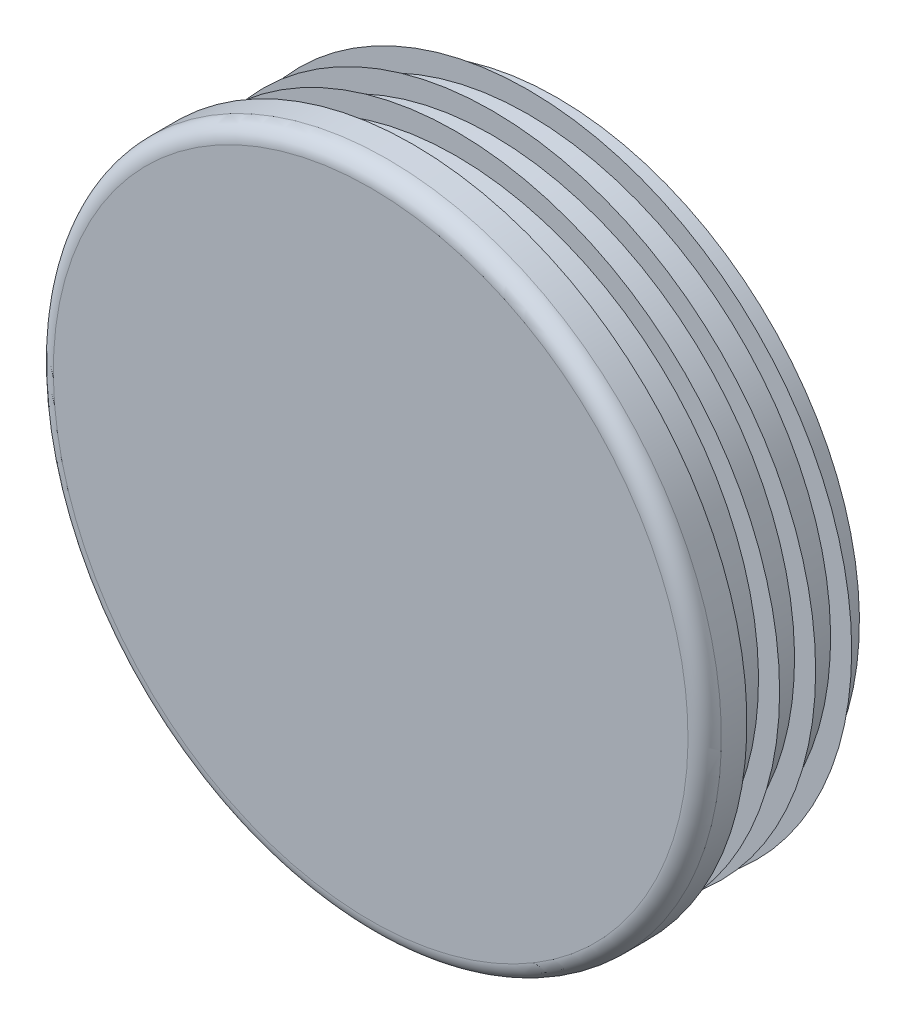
ISO-10303-21;
HEADER;
FILE_DESCRIPTION(('STEP AP214'),'2;1');
FILE_NAME('part.step','',(''),(''),'','','');
FILE_SCHEMA(('AUTOMOTIVE_DESIGN { 1 0 10303 214 1 1 1 1 }'));
ENDSEC;
DATA;
#1=APPLICATION_CONTEXT('core data for automotive mechanical design processes');
#2=APPLICATION_PROTOCOL_DEFINITION('international standard','automotive_design',2000,#1);
#3=PRODUCT_CONTEXT('',#1,'mechanical');
#4=PRODUCT('Part','Part','',(#3));
#5=PRODUCT_RELATED_PRODUCT_CATEGORY('part','',(#4));
#6=PRODUCT_DEFINITION_FORMATION('','',#4);
#7=PRODUCT_DEFINITION_CONTEXT('part definition',#1,'design');
#8=PRODUCT_DEFINITION('design','',#6,#7);
#9=PRODUCT_DEFINITION_SHAPE('','',#8);
#10=(LENGTH_UNIT() NAMED_UNIT(*) SI_UNIT(.MILLI.,.METRE.));
#11=(NAMED_UNIT(*) PLANE_ANGLE_UNIT() SI_UNIT($,.RADIAN.));
#12=(NAMED_UNIT(*) SI_UNIT($,.STERADIAN.) SOLID_ANGLE_UNIT());
#13=UNCERTAINTY_MEASURE_WITH_UNIT(LENGTH_MEASURE(1.E-05),#10,'distance_accuracy_value','');
#14=(GEOMETRIC_REPRESENTATION_CONTEXT(3) GLOBAL_UNCERTAINTY_ASSIGNED_CONTEXT((#13)) GLOBAL_UNIT_ASSIGNED_CONTEXT((#10,
#11,#12)) REPRESENTATION_CONTEXT('',''));
#15=CARTESIAN_POINT('',(0.,0.,0.));
#16=DIRECTION('',(0.,0.,1.));
#17=DIRECTION('',(1.,0.,0.));
#18=AXIS2_PLACEMENT_3D('',#15,#16,#17);
#19=CARTESIAN_POINT('',(0.,0.,6.));
#20=DIRECTION('',(0.,0.,-1.));
#21=DIRECTION('',(0.,1.,0.));
#22=AXIS2_PLACEMENT_3D('',#19,#20,#21);
#23=PLANE('',#22);
#24=CARTESIAN_POINT('',(0.,0.,6.));
#25=DIRECTION('',(0.,0.,-1.));
#26=DIRECTION('',(0.,1.,0.));
#27=AXIS2_PLACEMENT_3D('',#24,#25,#26);
#28=CIRCLE('',#27,45.125);
#29=CARTESIAN_POINT('',(0.,45.125,6.));
#30=VERTEX_POINT('',#29);
#31=EDGE_CURVE('E8',#30,#30,#28,.T.);
#32=ORIENTED_EDGE('',*,*,#31,.F.);
#33=EDGE_LOOP('',(#32));
#34=FACE_BOUND('',#33,.T.);
#35=ADVANCED_FACE('F12',(#34),#23,.F.);
#36=CARTESIAN_POINT('',(0.,0.,3.625));
#37=DIRECTION('',(0.,0.,-1.));
#38=DIRECTION('',(0.,1.,0.));
#39=AXIS2_PLACEMENT_3D('',#36,#37,#38);
#40=TOROIDAL_SURFACE('',#39,45.125,2.375);
#41=ORIENTED_EDGE('',*,*,#31,.T.);
#42=EDGE_LOOP('',(#41));
#43=FACE_BOUND('',#42,.T.);
#44=CARTESIAN_POINT('',(0.,0.,3.625));
#45=DIRECTION('',(0.,0.,-1.));
#46=DIRECTION('',(0.,1.,0.));
#47=AXIS2_PLACEMENT_3D('',#44,#45,#46);
#48=CIRCLE('',#47,47.5);
#49=CARTESIAN_POINT('',(0.,47.5,3.625));
#50=VERTEX_POINT('',#49);
#51=EDGE_CURVE('E18',#50,#50,#48,.T.);
#52=ORIENTED_EDGE('',*,*,#51,.F.);
#53=EDGE_LOOP('',(#52));
#54=FACE_BOUND('',#53,.T.);
#55=ADVANCED_FACE('F159',(#43,#54),#40,.T.);
#56=CARTESIAN_POINT('',(0.,0.,-20.5));
#57=DIRECTION('',(0.,0.,-1.));
#58=DIRECTION('',(0.,1.,0.));
#59=AXIS2_PLACEMENT_3D('',#56,#57,#58);
#60=CYLINDRICAL_SURFACE('',#59,47.5);
#61=CARTESIAN_POINT('',(0.,0.,0.));
#62=DIRECTION('',(0.,0.,-1.));
#63=DIRECTION('',(0.,1.,0.));
#64=AXIS2_PLACEMENT_3D('',#61,#62,#63);
#65=CIRCLE('',#64,47.5);
#66=CARTESIAN_POINT('',(0.,47.5,0.));
#67=VERTEX_POINT('',#66);
#68=EDGE_CURVE('E22',#67,#67,#65,.T.);
#69=ORIENTED_EDGE('',*,*,#68,.F.);
#70=EDGE_LOOP('',(#69));
#71=FACE_BOUND('',#70,.T.);
#72=ORIENTED_EDGE('',*,*,#51,.T.);
#73=EDGE_LOOP('',(#72));
#74=FACE_BOUND('',#73,.T.);
#75=ADVANCED_FACE('F154',(#71,#74),#60,.T.);
#76=CARTESIAN_POINT('',(47.5,0.,0.));
#77=DIRECTION('',(0.,0.,1.));
#78=DIRECTION('',(0.,-1.,0.));
#79=AXIS2_PLACEMENT_3D('',#76,#77,#78);
#80=PLANE('',#79);
#81=CARTESIAN_POINT('',(0.,0.,0.));
#82=DIRECTION('',(0.,0.,-1.));
#83=DIRECTION('',(0.,1.,0.));
#84=AXIS2_PLACEMENT_3D('',#81,#82,#83);
#85=CIRCLE('',#84,43.);
#86=CARTESIAN_POINT('',(0.,43.,0.));
#87=VERTEX_POINT('',#86);
#88=EDGE_CURVE('E26',#87,#87,#85,.T.);
#89=ORIENTED_EDGE('',*,*,#88,.F.);
#90=EDGE_LOOP('',(#89));
#91=FACE_BOUND('',#90,.T.);
#92=ORIENTED_EDGE('',*,*,#68,.T.);
#93=EDGE_LOOP('',(#92));
#94=FACE_BOUND('',#93,.T.);
#95=ADVANCED_FACE('F148',(#91,#94),#80,.F.);
#96=CARTESIAN_POINT('',(0.,0.,-20.5));
#97=DIRECTION('',(0.,0.,-1.));
#98=DIRECTION('',(0.,1.,0.));
#99=AXIS2_PLACEMENT_3D('',#96,#97,#98);
#100=CYLINDRICAL_SURFACE('',#99,43.);
#101=CARTESIAN_POINT('',(0.,0.,-1.025));
#102=DIRECTION('',(0.,0.,-1.));
#103=DIRECTION('',(0.,1.,0.));
#104=AXIS2_PLACEMENT_3D('',#101,#102,#103);
#105=CIRCLE('',#104,43.);
#106=CARTESIAN_POINT('',(0.,43.,-1.025));
#107=VERTEX_POINT('',#106);
#108=EDGE_CURVE('E31',#107,#107,#105,.T.);
#109=ORIENTED_EDGE('',*,*,#108,.F.);
#110=EDGE_LOOP('',(#109));
#111=FACE_BOUND('',#110,.T.);
#112=ORIENTED_EDGE('',*,*,#88,.T.);
#113=EDGE_LOOP('',(#112));
#114=FACE_BOUND('',#113,.T.);
#115=ADVANCED_FACE('F142',(#111,#114),#100,.T.);
#116=CARTESIAN_POINT('',(43.,0.,-1.025));
#117=DIRECTION('',(0.,0.,-1.));
#118=DIRECTION('',(0.,1.,0.));
#119=AXIS2_PLACEMENT_3D('',#116,#117,#118);
#120=PLANE('',#119);
#121=CARTESIAN_POINT('',(0.,0.,-1.025));
#122=DIRECTION('',(0.,0.,-1.));
#123=DIRECTION('',(0.,1.,0.));
#124=AXIS2_PLACEMENT_3D('',#121,#122,#123);
#125=CIRCLE('',#124,46.);
#126=CARTESIAN_POINT('',(0.,46.,-1.025));
#127=VERTEX_POINT('',#126);
#128=EDGE_CURVE('E34',#127,#127,#125,.T.);
#129=ORIENTED_EDGE('',*,*,#128,.F.);
#130=EDGE_LOOP('',(#129));
#131=FACE_BOUND('',#130,.T.);
#132=ORIENTED_EDGE('',*,*,#108,.T.);
#133=EDGE_LOOP('',(#132));
#134=FACE_BOUND('',#133,.T.);
#135=ADVANCED_FACE('F136',(#131,#134),#120,.F.);
#136=CARTESIAN_POINT('',(0.,0.,-1.025));
#137=DIRECTION('',(0.,0.,1.));
#138=DIRECTION('',(0.,-1.,0.));
#139=AXIS2_PLACEMENT_3D('',#136,#137,#138);
#140=CONICAL_SURFACE('',#139,46.,0.959931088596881);
#141=CARTESIAN_POINT('',(0.,0.,-3.12562261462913));
#142=DIRECTION('',(0.,0.,-1.));
#143=DIRECTION('',(0.,1.,0.));
#144=AXIS2_PLACEMENT_3D('',#141,#142,#143);
#145=CIRCLE('',#144,43.);
#146=CARTESIAN_POINT('',(0.,43.,-3.12562261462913));
#147=VERTEX_POINT('',#146);
#148=EDGE_CURVE('E37',#147,#147,#145,.T.);
#149=ORIENTED_EDGE('',*,*,#148,.F.);
#150=EDGE_LOOP('',(#149));
#151=FACE_BOUND('',#150,.T.);
#152=ORIENTED_EDGE('',*,*,#128,.T.);
#153=EDGE_LOOP('',(#152));
#154=FACE_BOUND('',#153,.T.);
#155=ADVANCED_FACE('F130',(#151,#154),#140,.T.);
#156=CARTESIAN_POINT('',(0.,0.,-20.5));
#157=DIRECTION('',(0.,0.,-1.));
#158=DIRECTION('',(0.,1.,0.));
#159=AXIS2_PLACEMENT_3D('',#156,#157,#158);
#160=CYLINDRICAL_SURFACE('',#159,43.);
#161=CARTESIAN_POINT('',(0.,0.,-6.15));
#162=DIRECTION('',(0.,0.,-1.));
#163=DIRECTION('',(0.,1.,0.));
#164=AXIS2_PLACEMENT_3D('',#161,#162,#163);
#165=CIRCLE('',#164,43.);
#166=CARTESIAN_POINT('',(0.,43.,-6.15));
#167=VERTEX_POINT('',#166);
#168=EDGE_CURVE('E40',#167,#167,#165,.T.);
#169=ORIENTED_EDGE('',*,*,#168,.F.);
#170=EDGE_LOOP('',(#169));
#171=FACE_BOUND('',#170,.T.);
#172=ORIENTED_EDGE('',*,*,#148,.T.);
#173=EDGE_LOOP('',(#172));
#174=FACE_BOUND('',#173,.T.);
#175=ADVANCED_FACE('F124',(#171,#174),#160,.T.);
#176=CARTESIAN_POINT('',(43.,0.,-6.15));
#177=DIRECTION('',(0.,0.,-1.));
#178=DIRECTION('',(0.,1.,0.));
#179=AXIS2_PLACEMENT_3D('',#176,#177,#178);
#180=PLANE('',#179);
#181=CARTESIAN_POINT('',(0.,0.,-6.15));
#182=DIRECTION('',(0.,0.,-1.));
#183=DIRECTION('',(0.,1.,0.));
#184=AXIS2_PLACEMENT_3D('',#181,#182,#183);
#185=CIRCLE('',#184,46.);
#186=CARTESIAN_POINT('',(0.,46.,-6.15));
#187=VERTEX_POINT('',#186);
#188=EDGE_CURVE('E43',#187,#187,#185,.T.);
#189=ORIENTED_EDGE('',*,*,#188,.F.);
#190=EDGE_LOOP('',(#189));
#191=FACE_BOUND('',#190,.T.);
#192=ORIENTED_EDGE('',*,*,#168,.T.);
#193=EDGE_LOOP('',(#192));
#194=FACE_BOUND('',#193,.T.);
#195=ADVANCED_FACE('F118',(#191,#194),#180,.F.);
#196=CARTESIAN_POINT('',(0.,0.,-6.15));
#197=DIRECTION('',(0.,0.,1.));
#198=DIRECTION('',(0.,-1.,0.));
#199=AXIS2_PLACEMENT_3D('',#196,#197,#198);
#200=CONICAL_SURFACE('',#199,46.,0.95993108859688);
#201=CARTESIAN_POINT('',(0.,0.,-8.25062261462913));
#202=DIRECTION('',(0.,0.,-1.));
#203=DIRECTION('',(0.,1.,0.));
#204=AXIS2_PLACEMENT_3D('',#201,#202,#203);
#205=CIRCLE('',#204,43.);
#206=CARTESIAN_POINT('',(0.,43.,-8.25062261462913));
#207=VERTEX_POINT('',#206);
#208=EDGE_CURVE('E46',#207,#207,#205,.T.);
#209=ORIENTED_EDGE('',*,*,#208,.F.);
#210=EDGE_LOOP('',(#209));
#211=FACE_BOUND('',#210,.T.);
#212=ORIENTED_EDGE('',*,*,#188,.T.);
#213=EDGE_LOOP('',(#212));
#214=FACE_BOUND('',#213,.T.);
#215=ADVANCED_FACE('F112',(#211,#214),#200,.T.);
#216=CARTESIAN_POINT('',(0.,0.,-20.5));
#217=DIRECTION('',(0.,0.,-1.));
#218=DIRECTION('',(0.,1.,0.));
#219=AXIS2_PLACEMENT_3D('',#216,#217,#218);
#220=CYLINDRICAL_SURFACE('',#219,43.);
#221=CARTESIAN_POINT('',(0.,0.,-11.275));
#222=DIRECTION('',(0.,0.,-1.));
#223=DIRECTION('',(0.,1.,0.));
#224=AXIS2_PLACEMENT_3D('',#221,#222,#223);
#225=CIRCLE('',#224,43.);
#226=CARTESIAN_POINT('',(0.,43.,-11.275));
#227=VERTEX_POINT('',#226);
#228=EDGE_CURVE('E49',#227,#227,#225,.T.);
#229=ORIENTED_EDGE('',*,*,#228,.F.);
#230=EDGE_LOOP('',(#229));
#231=FACE_BOUND('',#230,.T.);
#232=ORIENTED_EDGE('',*,*,#208,.T.);
#233=EDGE_LOOP('',(#232));
#234=FACE_BOUND('',#233,.T.);
#235=ADVANCED_FACE('F106',(#231,#234),#220,.T.);
#236=CARTESIAN_POINT('',(43.,0.,-11.275));
#237=DIRECTION('',(0.,0.,-1.));
#238=DIRECTION('',(0.,1.,0.));
#239=AXIS2_PLACEMENT_3D('',#236,#237,#238);
#240=PLANE('',#239);
#241=CARTESIAN_POINT('',(0.,0.,-11.275));
#242=DIRECTION('',(0.,0.,-1.));
#243=DIRECTION('',(0.,1.,0.));
#244=AXIS2_PLACEMENT_3D('',#241,#242,#243);
#245=CIRCLE('',#244,46.);
#246=CARTESIAN_POINT('',(0.,46.,-11.275));
#247=VERTEX_POINT('',#246);
#248=EDGE_CURVE('E52',#247,#247,#245,.T.);
#249=ORIENTED_EDGE('',*,*,#248,.F.);
#250=EDGE_LOOP('',(#249));
#251=FACE_BOUND('',#250,.T.);
#252=ORIENTED_EDGE('',*,*,#228,.T.);
#253=EDGE_LOOP('',(#252));
#254=FACE_BOUND('',#253,.T.);
#255=ADVANCED_FACE('F100',(#251,#254),#240,.F.);
#256=CARTESIAN_POINT('',(0.,0.,-11.275));
#257=DIRECTION('',(0.,0.,1.));
#258=DIRECTION('',(0.,-1.,0.));
#259=AXIS2_PLACEMENT_3D('',#256,#257,#258);
#260=CONICAL_SURFACE('',#259,46.,0.959931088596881);
#261=CARTESIAN_POINT('',(0.,0.,-13.3756226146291));
#262=DIRECTION('',(0.,0.,-1.));
#263=DIRECTION('',(0.,1.,0.));
#264=AXIS2_PLACEMENT_3D('',#261,#262,#263);
#265=CIRCLE('',#264,43.);
#266=CARTESIAN_POINT('',(0.,43.,-13.3756226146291));
#267=VERTEX_POINT('',#266);
#268=EDGE_CURVE('E55',#267,#267,#265,.T.);
#269=ORIENTED_EDGE('',*,*,#268,.F.);
#270=EDGE_LOOP('',(#269));
#271=FACE_BOUND('',#270,.T.);
#272=ORIENTED_EDGE('',*,*,#248,.T.);
#273=EDGE_LOOP('',(#272));
#274=FACE_BOUND('',#273,.T.);
#275=ADVANCED_FACE('F94',(#271,#274),#260,.T.);
#276=CARTESIAN_POINT('',(0.,0.,-20.5));
#277=DIRECTION('',(0.,0.,-1.));
#278=DIRECTION('',(0.,1.,0.));
#279=AXIS2_PLACEMENT_3D('',#276,#277,#278);
#280=CYLINDRICAL_SURFACE('',#279,43.);
#281=CARTESIAN_POINT('',(0.,0.,-16.4));
#282=DIRECTION('',(0.,0.,-1.));
#283=DIRECTION('',(0.,1.,0.));
#284=AXIS2_PLACEMENT_3D('',#281,#282,#283);
#285=CIRCLE('',#284,43.);
#286=CARTESIAN_POINT('',(0.,43.,-16.4));
#287=VERTEX_POINT('',#286);
#288=EDGE_CURVE('E58',#287,#287,#285,.T.);
#289=ORIENTED_EDGE('',*,*,#288,.F.);
#290=EDGE_LOOP('',(#289));
#291=FACE_BOUND('',#290,.T.);
#292=ORIENTED_EDGE('',*,*,#268,.T.);
#293=EDGE_LOOP('',(#292));
#294=FACE_BOUND('',#293,.T.);
#295=ADVANCED_FACE('F88',(#291,#294),#280,.T.);
#296=CARTESIAN_POINT('',(43.,0.,-16.4));
#297=DIRECTION('',(0.,0.,-1.));
#298=DIRECTION('',(0.,1.,0.));
#299=AXIS2_PLACEMENT_3D('',#296,#297,#298);
#300=PLANE('',#299);
#301=CARTESIAN_POINT('',(0.,0.,-16.4));
#302=DIRECTION('',(0.,0.,-1.));
#303=DIRECTION('',(0.,1.,0.));
#304=AXIS2_PLACEMENT_3D('',#301,#302,#303);
#305=CIRCLE('',#304,46.);
#306=CARTESIAN_POINT('',(0.,46.,-16.4));
#307=VERTEX_POINT('',#306);
#308=EDGE_CURVE('E61',#307,#307,#305,.T.);
#309=ORIENTED_EDGE('',*,*,#308,.F.);
#310=EDGE_LOOP('',(#309));
#311=FACE_BOUND('',#310,.T.);
#312=ORIENTED_EDGE('',*,*,#288,.T.);
#313=EDGE_LOOP('',(#312));
#314=FACE_BOUND('',#313,.T.);
#315=ADVANCED_FACE('F82',(#311,#314),#300,.F.);
#316=CARTESIAN_POINT('',(0.,0.,-16.4));
#317=DIRECTION('',(0.,0.,1.));
#318=DIRECTION('',(0.,-1.,0.));
#319=AXIS2_PLACEMENT_3D('',#316,#317,#318);
#320=CONICAL_SURFACE('',#319,46.,0.95993108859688);
#321=CARTESIAN_POINT('',(0.,0.,-18.5006226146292));
#322=DIRECTION('',(0.,0.,-1.));
#323=DIRECTION('',(0.,1.,0.));
#324=AXIS2_PLACEMENT_3D('',#321,#322,#323);
#325=CIRCLE('',#324,43.);
#326=CARTESIAN_POINT('',(0.,43.,-18.5006226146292));
#327=VERTEX_POINT('',#326);
#328=EDGE_CURVE('E64',#327,#327,#325,.T.);
#329=ORIENTED_EDGE('',*,*,#328,.F.);
#330=EDGE_LOOP('',(#329));
#331=FACE_BOUND('',#330,.T.);
#332=ORIENTED_EDGE('',*,*,#308,.T.);
#333=EDGE_LOOP('',(#332));
#334=FACE_BOUND('',#333,.T.);
#335=ADVANCED_FACE('F76',(#331,#334),#320,.T.);
#336=CARTESIAN_POINT('',(0.,0.,-20.5));
#337=DIRECTION('',(0.,0.,-1.));
#338=DIRECTION('',(0.,1.,0.));
#339=AXIS2_PLACEMENT_3D('',#336,#337,#338);
#340=CYLINDRICAL_SURFACE('',#339,43.);
#341=CARTESIAN_POINT('',(0.,0.,-20.5));
#342=DIRECTION('',(0.,0.,-1.));
#343=DIRECTION('',(0.,1.,0.));
#344=AXIS2_PLACEMENT_3D('',#341,#342,#343);
#345=CIRCLE('',#344,43.);
#346=CARTESIAN_POINT('',(0.,43.,-20.5));
#347=VERTEX_POINT('',#346);
#348=EDGE_CURVE('E67',#347,#347,#345,.T.);
#349=ORIENTED_EDGE('',*,*,#348,.F.);
#350=EDGE_LOOP('',(#349));
#351=FACE_BOUND('',#350,.T.);
#352=ORIENTED_EDGE('',*,*,#328,.T.);
#353=EDGE_LOOP('',(#352));
#354=FACE_BOUND('',#353,.T.);
#355=ADVANCED_FACE('F73',(#351,#354),#340,.T.);
#356=CARTESIAN_POINT('',(43.,0.,-20.5));
#357=DIRECTION('',(0.,0.,1.));
#358=DIRECTION('',(0.,-1.,0.));
#359=AXIS2_PLACEMENT_3D('',#356,#357,#358);
#360=PLANE('',#359);
#361=ORIENTED_EDGE('',*,*,#348,.T.);
#362=EDGE_LOOP('',(#361));
#363=FACE_BOUND('',#362,.T.);
#364=ADVANCED_FACE('F71',(#363),#360,.F.);
#365=CLOSED_SHELL('',(#35,#55,#75,#95,#115,#135,#155,#175,#195,#215,#235,#255,#275,#295,#315,
#335,#355,#364));
#366=MANIFOLD_SOLID_BREP('B1',#365);
#367=ADVANCED_BREP_SHAPE_REPRESENTATION('',(#18,#366),#14);
#368=SHAPE_DEFINITION_REPRESENTATION(#9,#367);
ENDSEC;
END-ISO-10303-21;
